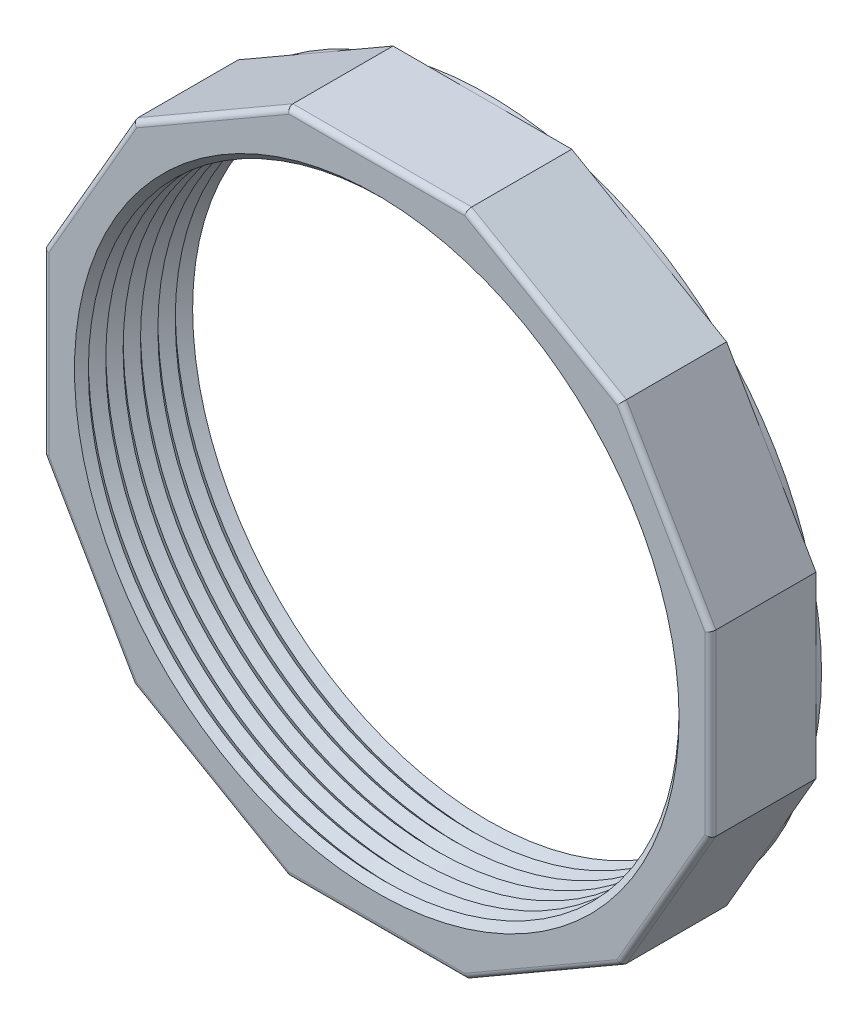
ISO-10303-21;
HEADER;
FILE_DESCRIPTION(('STEP AP214'),'2;1');
FILE_NAME('part.step','',(''),(''),'','','');
FILE_SCHEMA(('AUTOMOTIVE_DESIGN { 1 0 10303 214 1 1 1 1 }'));
ENDSEC;
DATA;
#1=APPLICATION_CONTEXT('core data for automotive mechanical design processes');
#2=APPLICATION_PROTOCOL_DEFINITION('international standard','automotive_design',2000,#1);
#3=PRODUCT_CONTEXT('',#1,'mechanical');
#4=PRODUCT('Part','Part','',(#3));
#5=PRODUCT_RELATED_PRODUCT_CATEGORY('part','',(#4));
#6=PRODUCT_DEFINITION_FORMATION('','',#4);
#7=PRODUCT_DEFINITION_CONTEXT('part definition',#1,'design');
#8=PRODUCT_DEFINITION('design','',#6,#7);
#9=PRODUCT_DEFINITION_SHAPE('','',#8);
#10=(LENGTH_UNIT() NAMED_UNIT(*) SI_UNIT(.MILLI.,.METRE.));
#11=(NAMED_UNIT(*) PLANE_ANGLE_UNIT() SI_UNIT($,.RADIAN.));
#12=(NAMED_UNIT(*) SI_UNIT($,.STERADIAN.) SOLID_ANGLE_UNIT());
#13=UNCERTAINTY_MEASURE_WITH_UNIT(LENGTH_MEASURE(1.E-05),#10,'distance_accuracy_value','');
#14=(GEOMETRIC_REPRESENTATION_CONTEXT(3) GLOBAL_UNCERTAINTY_ASSIGNED_CONTEXT((#13)) GLOBAL_UNIT_ASSIGNED_CONTEXT((#10,
#11,#12)) REPRESENTATION_CONTEXT('',''));
#15=CARTESIAN_POINT('',(0.,0.,0.));
#16=DIRECTION('',(0.,0.,1.));
#17=DIRECTION('',(1.,0.,0.));
#18=AXIS2_PLACEMENT_3D('',#15,#16,#17);
#19=CARTESIAN_POINT('',(0.,0.,3.571875));
#20=DIRECTION('',(0.,0.,-1.));
#21=DIRECTION('',(-1.,0.,0.));
#22=AXIS2_PLACEMENT_3D('',#19,#20,#21);
#23=CONICAL_SURFACE('',#22,13.890625,0.785398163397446);
#24=CARTESIAN_POINT('',(0.,0.,3.571875));
#25=DIRECTION('',(0.,0.,1.));
#26=DIRECTION('',(1.,0.,0.));
#27=AXIS2_PLACEMENT_3D('',#24,#25,#26);
#28=CIRCLE('',#27,13.890625);
#29=CARTESIAN_POINT('',(13.890625,0.,3.571875));
#30=VERTEX_POINT('',#29);
#31=EDGE_CURVE('E202',#30,#30,#28,.F.);
#32=ORIENTED_EDGE('',*,*,#31,.T.);
#33=EDGE_LOOP('',(#32));
#34=FACE_BOUND('',#33,.T.);
#35=CARTESIAN_POINT('',(0.,0.,3.96875));
#36=DIRECTION('',(0.,0.,1.));
#37=DIRECTION('',(1.,0.,0.));
#38=AXIS2_PLACEMENT_3D('',#35,#36,#37);
#39=CIRCLE('',#38,13.49375);
#40=CARTESIAN_POINT('',(13.49375,0.,3.96875));
#41=VERTEX_POINT('',#40);
#42=EDGE_CURVE('E199',#41,#41,#39,.T.);
#43=ORIENTED_EDGE('',*,*,#42,.T.);
#44=EDGE_LOOP('',(#43));
#45=FACE_BOUND('',#44,.T.);
#46=ADVANCED_FACE('F17',(#34,#45),#23,.F.);
#47=CARTESIAN_POINT('',(0.,0.,3.571875));
#48=DIRECTION('',(0.,0.,1.));
#49=DIRECTION('',(1.,0.,0.));
#50=AXIS2_PLACEMENT_3D('',#47,#48,#49);
#51=CONICAL_SURFACE('',#50,13.890625,0.785398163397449);
#52=ORIENTED_EDGE('',*,*,#31,.F.);
#53=EDGE_LOOP('',(#52));
#54=FACE_BOUND('',#53,.T.);
#55=CARTESIAN_POINT('',(0.,0.,3.175));
#56=DIRECTION('',(0.,0.,-1.));
#57=DIRECTION('',(-1.,0.,0.));
#58=AXIS2_PLACEMENT_3D('',#55,#56,#57);
#59=CIRCLE('',#58,13.49375);
#60=CARTESIAN_POINT('',(-13.49375,0.,3.175));
#61=VERTEX_POINT('',#60);
#62=EDGE_CURVE('E196',#61,#61,#59,.T.);
#63=ORIENTED_EDGE('',*,*,#62,.T.);
#64=EDGE_LOOP('',(#63));
#65=FACE_BOUND('',#64,.T.);
#66=ADVANCED_FACE('F728',(#54,#65),#51,.F.);
#67=CARTESIAN_POINT('',(0.,0.,4.365625));
#68=DIRECTION('',(0.,0.,1.));
#69=DIRECTION('',(1.,0.,0.));
#70=AXIS2_PLACEMENT_3D('',#67,#68,#69);
#71=CONICAL_SURFACE('',#70,13.890625,0.785398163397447);
#72=CARTESIAN_POINT('',(0.,0.,4.365625));
#73=DIRECTION('',(0.,0.,-1.));
#74=DIRECTION('',(0.,1.,0.));
#75=AXIS2_PLACEMENT_3D('',#72,#73,#74);
#76=CIRCLE('',#75,13.890625);
#77=CARTESIAN_POINT('',(0.,13.890625,4.365625));
#78=VERTEX_POINT('',#77);
#79=EDGE_CURVE('E193',#78,#78,#76,.F.);
#80=ORIENTED_EDGE('',*,*,#79,.T.);
#81=EDGE_LOOP('',(#80));
#82=FACE_BOUND('',#81,.T.);
#83=ORIENTED_EDGE('',*,*,#42,.F.);
#84=EDGE_LOOP('',(#83));
#85=FACE_BOUND('',#84,.T.);
#86=ADVANCED_FACE('F725',(#82,#85),#71,.F.);
#87=CARTESIAN_POINT('',(0.,0.,2.778125));
#88=DIRECTION('',(0.,0.,-1.));
#89=DIRECTION('',(-1.,0.,0.));
#90=AXIS2_PLACEMENT_3D('',#87,#88,#89);
#91=CONICAL_SURFACE('',#90,13.890625,0.785398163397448);
#92=CARTESIAN_POINT('',(0.,0.,2.778125));
#93=DIRECTION('',(0.,0.,1.));
#94=DIRECTION('',(1.,0.,0.));
#95=AXIS2_PLACEMENT_3D('',#92,#93,#94);
#96=CIRCLE('',#95,13.890625);
#97=CARTESIAN_POINT('',(13.890625,0.,2.778125));
#98=VERTEX_POINT('',#97);
#99=EDGE_CURVE('E190',#98,#98,#96,.F.);
#100=ORIENTED_EDGE('',*,*,#99,.T.);
#101=EDGE_LOOP('',(#100));
#102=FACE_BOUND('',#101,.T.);
#103=ORIENTED_EDGE('',*,*,#62,.F.);
#104=EDGE_LOOP('',(#103));
#105=FACE_BOUND('',#104,.T.);
#106=ADVANCED_FACE('F721',(#102,#105),#91,.F.);
#107=CARTESIAN_POINT('',(0.,0.,4.365625));
#108=DIRECTION('',(0.,0.,-1.));
#109=DIRECTION('',(0.,1.,0.));
#110=AXIS2_PLACEMENT_3D('',#107,#108,#109);
#111=CONICAL_SURFACE('',#110,13.890625,0.785398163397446);
#112=ORIENTED_EDGE('',*,*,#79,.F.);
#113=EDGE_LOOP('',(#112));
#114=FACE_BOUND('',#113,.T.);
#115=CARTESIAN_POINT('',(0.,0.,4.7625));
#116=DIRECTION('',(0.,0.,1.));
#117=DIRECTION('',(1.,0.,0.));
#118=AXIS2_PLACEMENT_3D('',#115,#116,#117);
#119=CIRCLE('',#118,13.49375);
#120=CARTESIAN_POINT('',(13.49375,0.,4.7625));
#121=VERTEX_POINT('',#120);
#122=EDGE_CURVE('E187',#121,#121,#119,.T.);
#123=ORIENTED_EDGE('',*,*,#122,.T.);
#124=EDGE_LOOP('',(#123));
#125=FACE_BOUND('',#124,.T.);
#126=ADVANCED_FACE('F717',(#114,#125),#111,.F.);
#127=CARTESIAN_POINT('',(0.,0.,2.778125));
#128=DIRECTION('',(0.,0.,1.));
#129=DIRECTION('',(1.,0.,0.));
#130=AXIS2_PLACEMENT_3D('',#127,#128,#129);
#131=CONICAL_SURFACE('',#130,13.890625,0.785398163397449);
#132=ORIENTED_EDGE('',*,*,#99,.F.);
#133=EDGE_LOOP('',(#132));
#134=FACE_BOUND('',#133,.T.);
#135=CARTESIAN_POINT('',(0.,0.,2.38125));
#136=DIRECTION('',(0.,0.,-1.));
#137=DIRECTION('',(-1.,0.,0.));
#138=AXIS2_PLACEMENT_3D('',#135,#136,#137);
#139=CIRCLE('',#138,13.49375);
#140=CARTESIAN_POINT('',(-13.49375,0.,2.38125));
#141=VERTEX_POINT('',#140);
#142=EDGE_CURVE('E184',#141,#141,#139,.T.);
#143=ORIENTED_EDGE('',*,*,#142,.T.);
#144=EDGE_LOOP('',(#143));
#145=FACE_BOUND('',#144,.T.);
#146=ADVANCED_FACE('F713',(#134,#145),#131,.F.);
#147=CARTESIAN_POINT('',(0.,0.,5.08));
#148=DIRECTION('',(0.,0.,1.));
#149=DIRECTION('',(1.,0.,0.));
#150=AXIS2_PLACEMENT_3D('',#147,#148,#149);
#151=CONICAL_SURFACE('',#150,13.81125,0.785398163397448);
#152=ORIENTED_EDGE('',*,*,#122,.F.);
#153=EDGE_LOOP('',(#152));
#154=FACE_BOUND('',#153,.T.);
#155=CARTESIAN_POINT('',(0.,0.,5.08));
#156=DIRECTION('',(0.,0.,1.));
#157=DIRECTION('',(1.,0.,0.));
#158=AXIS2_PLACEMENT_3D('',#155,#156,#157);
#159=CIRCLE('',#158,13.81125);
#160=CARTESIAN_POINT('',(13.81125,0.,5.08));
#161=VERTEX_POINT('',#160);
#162=EDGE_CURVE('E20',#161,#161,#159,.F.);
#163=ORIENTED_EDGE('',*,*,#162,.F.);
#164=EDGE_LOOP('',(#163));
#165=FACE_BOUND('',#164,.T.);
#166=ADVANCED_FACE('F709',(#154,#165),#151,.F.);
#167=CARTESIAN_POINT('',(0.,0.,1.984375));
#168=DIRECTION('',(0.,0.,-1.));
#169=DIRECTION('',(-1.,0.,0.));
#170=AXIS2_PLACEMENT_3D('',#167,#168,#169);
#171=CONICAL_SURFACE('',#170,13.890625,0.785398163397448);
#172=CARTESIAN_POINT('',(0.,0.,1.984375));
#173=DIRECTION('',(0.,0.,1.));
#174=DIRECTION('',(1.,0.,0.));
#175=AXIS2_PLACEMENT_3D('',#172,#173,#174);
#176=CIRCLE('',#175,13.890625);
#177=CARTESIAN_POINT('',(13.890625,0.,1.984375));
#178=VERTEX_POINT('',#177);
#179=EDGE_CURVE('E178',#178,#178,#176,.F.);
#180=ORIENTED_EDGE('',*,*,#179,.T.);
#181=EDGE_LOOP('',(#180));
#182=FACE_BOUND('',#181,.T.);
#183=ORIENTED_EDGE('',*,*,#142,.F.);
#184=EDGE_LOOP('',(#183));
#185=FACE_BOUND('',#184,.T.);
#186=ADVANCED_FACE('F706',(#182,#185),#171,.F.);
#187=CARTESIAN_POINT('',(0.,0.,5.08));
#188=DIRECTION('',(0.,0.,1.));
#189=DIRECTION('',(1.,0.,0.));
#190=AXIS2_PLACEMENT_3D('',#187,#188,#189);
#191=PLANE('',#190);
#192=DIRECTION('',(0.866025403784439,-0.5,0.));
#193=VECTOR('',#192,1.);
#194=CARTESIAN_POINT('',(7.493,12.9782567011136,5.08));
#195=LINE('',#194,#193);
#196=CARTESIAN_POINT('',(4.01548659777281,14.986,5.08));
#197=VERTEX_POINT('',#196);
#198=CARTESIAN_POINT('',(10.9705134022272,10.9705134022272,5.08));
#199=VERTEX_POINT('',#198);
#200=EDGE_CURVE('E277',#197,#199,#195,.T.);
#201=ORIENTED_EDGE('',*,*,#200,.F.);
#202=DIRECTION('',(-1.,0.,0.));
#203=VECTOR('',#202,1.);
#204=CARTESIAN_POINT('',(4.08354569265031,14.986,5.08));
#205=LINE('',#204,#203);
#206=CARTESIAN_POINT('',(-4.01548659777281,14.986,5.08));
#207=VERTEX_POINT('',#206);
#208=EDGE_CURVE('E174',#207,#197,#205,.F.);
#209=ORIENTED_EDGE('',*,*,#208,.F.);
#210=DIRECTION('',(0.866025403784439,0.5,0.));
#211=VECTOR('',#210,1.);
#212=CARTESIAN_POINT('',(-7.493,12.9782567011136,5.08));
#213=LINE('',#212,#211);
#214=CARTESIAN_POINT('',(-10.9705134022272,10.9705134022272,5.08));
#215=VERTEX_POINT('',#214);
#216=EDGE_CURVE('E162',#215,#207,#213,.T.);
#217=ORIENTED_EDGE('',*,*,#216,.F.);
#218=DIRECTION('',(-0.5,-0.866025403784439,0.));
#219=VECTOR('',#218,1.);
#220=CARTESIAN_POINT('',(-10.9364838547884,11.0294543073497,5.08));
#221=LINE('',#220,#219);
#222=CARTESIAN_POINT('',(-14.986,4.01548659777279,5.08));
#223=VERTEX_POINT('',#222);
#224=EDGE_CURVE('E159',#223,#215,#221,.F.);
#225=ORIENTED_EDGE('',*,*,#224,.F.);
#226=DIRECTION('',(0.,1.,0.));
#227=VECTOR('',#226,1.);
#228=CARTESIAN_POINT('',(-14.986,0.,5.08));
#229=LINE('',#228,#227);
#230=CARTESIAN_POINT('',(-14.986,-4.01548659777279,5.08));
#231=VERTEX_POINT('',#230);
#232=EDGE_CURVE('E250',#231,#223,#229,.T.);
#233=ORIENTED_EDGE('',*,*,#232,.F.);
#234=DIRECTION('',(0.5,-0.866025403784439,0.));
#235=VECTOR('',#234,1.);
#236=CARTESIAN_POINT('',(-15.0200295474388,-3.9565456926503,5.08));
#237=LINE('',#236,#235);
#238=CARTESIAN_POINT('',(-10.9705134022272,-10.9705134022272,5.08));
#239=VERTEX_POINT('',#238);
#240=EDGE_CURVE('E181',#239,#231,#237,.F.);
#241=ORIENTED_EDGE('',*,*,#240,.F.);
#242=DIRECTION('',(-0.866025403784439,0.5,0.));
#243=VECTOR('',#242,1.);
#244=CARTESIAN_POINT('',(-7.493,-12.9782567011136,5.08));
#245=LINE('',#244,#243);
#246=CARTESIAN_POINT('',(-4.01548659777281,-14.986,5.08));
#247=VERTEX_POINT('',#246);
#248=EDGE_CURVE('E253',#247,#239,#245,.T.);
#249=ORIENTED_EDGE('',*,*,#248,.F.);
#250=DIRECTION('',(1.,0.,0.));
#251=VECTOR('',#250,1.);
#252=CARTESIAN_POINT('',(-4.08354569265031,-14.986,5.08));
#253=LINE('',#252,#251);
#254=CARTESIAN_POINT('',(4.01548659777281,-14.986,5.08));
#255=VERTEX_POINT('',#254);
#256=EDGE_CURVE('E257',#255,#247,#253,.F.);
#257=ORIENTED_EDGE('',*,*,#256,.F.);
#258=DIRECTION('',(-0.866025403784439,-0.5,0.));
#259=VECTOR('',#258,1.);
#260=CARTESIAN_POINT('',(7.493,-12.9782567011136,5.08));
#261=LINE('',#260,#259);
#262=CARTESIAN_POINT('',(10.9705134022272,-10.9705134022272,5.08));
#263=VERTEX_POINT('',#262);
#264=EDGE_CURVE('E261',#263,#255,#261,.T.);
#265=ORIENTED_EDGE('',*,*,#264,.F.);
#266=DIRECTION('',(0.5,0.866025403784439,0.));
#267=VECTOR('',#266,1.);
#268=CARTESIAN_POINT('',(10.9364838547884,-11.0294543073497,5.08));
#269=LINE('',#268,#267);
#270=CARTESIAN_POINT('',(14.986,-4.01548659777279,5.08));
#271=VERTEX_POINT('',#270);
#272=EDGE_CURVE('E265',#271,#263,#269,.F.);
#273=ORIENTED_EDGE('',*,*,#272,.F.);
#274=DIRECTION('',(0.,-1.,0.));
#275=VECTOR('',#274,1.);
#276=CARTESIAN_POINT('',(14.986,0.,5.08));
#277=LINE('',#276,#275);
#278=CARTESIAN_POINT('',(14.986,4.0154865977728,5.08));
#279=VERTEX_POINT('',#278);
#280=EDGE_CURVE('E269',#279,#271,#277,.T.);
#281=ORIENTED_EDGE('',*,*,#280,.F.);
#282=DIRECTION('',(-0.5,0.866025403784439,0.));
#283=VECTOR('',#282,1.);
#284=CARTESIAN_POINT('',(15.0200295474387,3.9565456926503,5.08));
#285=LINE('',#284,#283);
#286=EDGE_CURVE('E273',#199,#279,#285,.F.);
#287=ORIENTED_EDGE('',*,*,#286,.F.);
#288=EDGE_LOOP('',(#201,#209,#217,#225,#233,#241,#249,#257,#265,#273,#281,#287));
#289=FACE_BOUND('',#288,.T.);
#290=ORIENTED_EDGE('',*,*,#162,.T.);
#291=EDGE_LOOP('',(#290));
#292=FACE_BOUND('',#291,.T.);
#293=ADVANCED_FACE('F293',(#289,#292),#191,.T.);
#294=CARTESIAN_POINT('',(0.,0.,1.984375));
#295=DIRECTION('',(0.,0.,1.));
#296=DIRECTION('',(1.,0.,0.));
#297=AXIS2_PLACEMENT_3D('',#294,#295,#296);
#298=CONICAL_SURFACE('',#297,13.890625,0.785398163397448);
#299=ORIENTED_EDGE('',*,*,#179,.F.);
#300=EDGE_LOOP('',(#299));
#301=FACE_BOUND('',#300,.T.);
#302=CARTESIAN_POINT('',(0.,0.,1.5875));
#303=DIRECTION('',(0.,0.,-1.));
#304=DIRECTION('',(-1.,0.,0.));
#305=AXIS2_PLACEMENT_3D('',#302,#303,#304);
#306=CIRCLE('',#305,13.49375);
#307=CARTESIAN_POINT('',(-13.49375,0.,1.5875));
#308=VERTEX_POINT('',#307);
#309=EDGE_CURVE('E142',#308,#308,#306,.T.);
#310=ORIENTED_EDGE('',*,*,#309,.T.);
#311=EDGE_LOOP('',(#310));
#312=FACE_BOUND('',#311,.T.);
#313=ADVANCED_FACE('F700',(#301,#312),#298,.F.);
#314=CARTESIAN_POINT('',(-10.9364838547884,11.0294543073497,4.826));
#315=DIRECTION('',(-0.5,-0.866025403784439,0.));
#316=DIRECTION('',(0.866025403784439,-0.5,0.));
#317=AXIS2_PLACEMENT_3D('',#314,#315,#316);
#318=CYLINDRICAL_SURFACE('',#317,0.254);
#319=CARTESIAN_POINT('',(-14.986,4.01548659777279,4.826));
#320=DIRECTION('',(0.258819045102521,0.965925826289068,0.));
#321=DIRECTION('',(-0.965925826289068,0.258819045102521,0.));
#322=AXIS2_PLACEMENT_3D('',#319,#320,#321);
#323=ELLIPSE('',#322,0.262960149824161,0.254);
#324=CARTESIAN_POINT('',(-15.24,4.08354569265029,4.826));
#325=VERTEX_POINT('',#324);
#326=EDGE_CURVE('E251',#223,#325,#323,.F.);
#327=ORIENTED_EDGE('',*,*,#326,.F.);
#328=ORIENTED_EDGE('',*,*,#224,.T.);
#329=CARTESIAN_POINT('',(-10.9705134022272,10.9705134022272,4.826));
#330=DIRECTION('',(0.707106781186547,0.707106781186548,0.));
#331=DIRECTION('',(0.707106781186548,-0.707106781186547,0.));
#332=AXIS2_PLACEMENT_3D('',#329,#330,#331);
#333=ELLIPSE('',#332,0.262960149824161,0.254);
#334=CARTESIAN_POINT('',(-11.1564543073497,11.1564543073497,4.826));
#335=VERTEX_POINT('',#334);
#336=EDGE_CURVE('E157',#335,#215,#333,.T.);
#337=ORIENTED_EDGE('',*,*,#336,.F.);
#338=DIRECTION('',(0.5,0.866025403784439,0.));
#339=VECTOR('',#338,1.);
#340=CARTESIAN_POINT('',(-11.1564543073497,11.1564543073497,4.826));
#341=LINE('',#340,#339);
#342=EDGE_CURVE('E128',#335,#325,#341,.F.);
#343=ORIENTED_EDGE('',*,*,#342,.T.);
#344=EDGE_LOOP('',(#327,#328,#337,#343));
#345=FACE_BOUND('',#344,.T.);
#346=ADVANCED_FACE('F158',(#345),#318,.T.);
#347=CARTESIAN_POINT('',(-7.493,12.9782567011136,4.826));
#348=DIRECTION('',(0.866025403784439,0.5,0.));
#349=DIRECTION('',(-0.5,0.866025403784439,0.));
#350=AXIS2_PLACEMENT_3D('',#347,#348,#349);
#351=CYLINDRICAL_SURFACE('',#350,0.254);
#352=CARTESIAN_POINT('',(-4.0154865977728,14.986,4.826));
#353=DIRECTION('',(-0.965925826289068,-0.258819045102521,0.));
#354=DIRECTION('',(-0.258819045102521,0.965925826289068,0.));
#355=AXIS2_PLACEMENT_3D('',#352,#353,#354);
#356=ELLIPSE('',#355,0.262960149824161,0.254);
#357=CARTESIAN_POINT('',(-4.08354569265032,15.24,4.826));
#358=VERTEX_POINT('',#357);
#359=EDGE_CURVE('E166',#358,#207,#356,.F.);
#360=ORIENTED_EDGE('',*,*,#359,.F.);
#361=DIRECTION('',(0.866025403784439,0.5,0.));
#362=VECTOR('',#361,1.);
#363=CARTESIAN_POINT('',(-15.0031551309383,8.93556055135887,4.826));
#364=LINE('',#363,#362);
#365=EDGE_CURVE('E149',#358,#335,#364,.F.);
#366=ORIENTED_EDGE('',*,*,#365,.T.);
#367=ORIENTED_EDGE('',*,*,#336,.T.);
#368=ORIENTED_EDGE('',*,*,#216,.T.);
#369=EDGE_LOOP('',(#360,#366,#367,#368));
#370=FACE_BOUND('',#369,.T.);
#371=ADVANCED_FACE('F164',(#370),#351,.T.);
#372=CARTESIAN_POINT('',(4.08354569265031,14.986,4.826));
#373=DIRECTION('',(-1.,0.,0.));
#374=DIRECTION('',(0.,-1.,0.));
#375=AXIS2_PLACEMENT_3D('',#372,#373,#374);
#376=CYLINDRICAL_SURFACE('',#375,0.254000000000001);
#377=CARTESIAN_POINT('',(4.01548659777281,14.986,4.826));
#378=DIRECTION('',(0.965925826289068,-0.258819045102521,0.));
#379=DIRECTION('',(-0.258819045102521,-0.965925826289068,0.));
#380=AXIS2_PLACEMENT_3D('',#377,#378,#379);
#381=ELLIPSE('',#380,0.262960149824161,0.254);
#382=CARTESIAN_POINT('',(4.08354569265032,15.24,4.826));
#383=VERTEX_POINT('',#382);
#384=EDGE_CURVE('E278',#383,#197,#381,.T.);
#385=ORIENTED_EDGE('',*,*,#384,.F.);
#386=DIRECTION('',(1.,0.,0.));
#387=VECTOR('',#386,1.);
#388=CARTESIAN_POINT('',(4.08354569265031,15.24,4.826));
#389=LINE('',#388,#387);
#390=EDGE_CURVE('E170',#383,#358,#389,.F.);
#391=ORIENTED_EDGE('',*,*,#390,.T.);
#392=ORIENTED_EDGE('',*,*,#359,.T.);
#393=ORIENTED_EDGE('',*,*,#208,.T.);
#394=EDGE_LOOP('',(#385,#391,#392,#393));
#395=FACE_BOUND('',#394,.T.);
#396=ADVANCED_FACE('F284',(#395),#376,.T.);
#397=CARTESIAN_POINT('',(7.493,12.9782567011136,4.826));
#398=DIRECTION('',(0.866025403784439,-0.5,0.));
#399=DIRECTION('',(0.5,0.866025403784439,0.));
#400=AXIS2_PLACEMENT_3D('',#397,#398,#399);
#401=CYLINDRICAL_SURFACE('',#400,0.254);
#402=CARTESIAN_POINT('',(10.9705134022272,10.9705134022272,4.826));
#403=DIRECTION('',(-0.707106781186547,0.707106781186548,0.));
#404=DIRECTION('',(0.707106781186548,0.707106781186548,0.));
#405=AXIS2_PLACEMENT_3D('',#402,#403,#404);
#406=ELLIPSE('',#405,0.262960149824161,0.254);
#407=CARTESIAN_POINT('',(11.1564543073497,11.1564543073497,4.826));
#408=VERTEX_POINT('',#407);
#409=EDGE_CURVE('E274',#408,#199,#406,.F.);
#410=ORIENTED_EDGE('',*,*,#409,.F.);
#411=DIRECTION('',(0.866025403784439,-0.5,0.));
#412=VECTOR('',#411,1.);
#413=CARTESIAN_POINT('',(0.236844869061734,17.4608937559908,4.826));
#414=LINE('',#413,#412);
#415=EDGE_CURVE('E291',#408,#383,#414,.F.);
#416=ORIENTED_EDGE('',*,*,#415,.T.);
#417=ORIENTED_EDGE('',*,*,#384,.T.);
#418=ORIENTED_EDGE('',*,*,#200,.T.);
#419=EDGE_LOOP('',(#410,#416,#417,#418));
#420=FACE_BOUND('',#419,.T.);
#421=ADVANCED_FACE('F290',(#420),#401,.T.);
#422=CARTESIAN_POINT('',(15.0200295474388,3.9565456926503,4.826));
#423=DIRECTION('',(-0.5,0.866025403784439,0.));
#424=DIRECTION('',(-0.866025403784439,-0.5,0.));
#425=AXIS2_PLACEMENT_3D('',#422,#423,#424);
#426=CYLINDRICAL_SURFACE('',#425,0.254);
#427=CARTESIAN_POINT('',(14.986,4.0154865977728,4.826));
#428=DIRECTION('',(0.258819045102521,-0.965925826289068,0.));
#429=DIRECTION('',(-0.965925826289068,-0.258819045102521,0.));
#430=AXIS2_PLACEMENT_3D('',#427,#428,#429);
#431=ELLIPSE('',#430,0.262960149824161,0.254);
#432=CARTESIAN_POINT('',(15.24,4.0835456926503,4.826));
#433=VERTEX_POINT('',#432);
#434=EDGE_CURVE('E270',#433,#279,#431,.T.);
#435=ORIENTED_EDGE('',*,*,#434,.F.);
#436=DIRECTION('',(0.5,-0.866025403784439,0.));
#437=VECTOR('',#436,1.);
#438=CARTESIAN_POINT('',(15.24,4.08354569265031,4.826));
#439=LINE('',#438,#437);
#440=EDGE_CURVE('E327',#433,#408,#439,.F.);
#441=ORIENTED_EDGE('',*,*,#440,.T.);
#442=ORIENTED_EDGE('',*,*,#409,.T.);
#443=ORIENTED_EDGE('',*,*,#286,.T.);
#444=EDGE_LOOP('',(#435,#441,#442,#443));
#445=FACE_BOUND('',#444,.T.);
#446=ADVANCED_FACE('F370',(#445),#426,.T.);
#447=CARTESIAN_POINT('',(14.986,0.,4.826));
#448=DIRECTION('',(0.,-1.,0.));
#449=DIRECTION('',(0.,0.,-1.));
#450=AXIS2_PLACEMENT_3D('',#447,#448,#449);
#451=CYLINDRICAL_SURFACE('',#450,0.254);
#452=CARTESIAN_POINT('',(14.986,-4.0154865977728,4.826));
#453=DIRECTION('',(0.258819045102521,0.965925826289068,0.));
#454=DIRECTION('',(0.965925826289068,-0.258819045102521,0.));
#455=AXIS2_PLACEMENT_3D('',#452,#453,#454);
#456=ELLIPSE('',#455,0.262960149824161,0.254);
#457=CARTESIAN_POINT('',(15.24,-4.0835456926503,4.826));
#458=VERTEX_POINT('',#457);
#459=EDGE_CURVE('E266',#458,#271,#456,.F.);
#460=ORIENTED_EDGE('',*,*,#459,.F.);
#461=DIRECTION('',(0.,1.,0.));
#462=VECTOR('',#461,1.);
#463=CARTESIAN_POINT('',(15.24,8.52533320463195,4.826));
#464=LINE('',#463,#462);
#465=EDGE_CURVE('E326',#458,#433,#464,.T.);
#466=ORIENTED_EDGE('',*,*,#465,.T.);
#467=ORIENTED_EDGE('',*,*,#434,.T.);
#468=ORIENTED_EDGE('',*,*,#280,.T.);
#469=EDGE_LOOP('',(#460,#466,#467,#468));
#470=FACE_BOUND('',#469,.T.);
#471=ADVANCED_FACE('F373',(#470),#451,.T.);
#472=CARTESIAN_POINT('',(10.9364838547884,-11.0294543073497,4.826));
#473=DIRECTION('',(0.5,0.866025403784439,0.));
#474=DIRECTION('',(-0.866025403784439,0.5,0.));
#475=AXIS2_PLACEMENT_3D('',#472,#473,#474);
#476=CYLINDRICAL_SURFACE('',#475,0.254);
#477=ORIENTED_EDGE('',*,*,#459,.T.);
#478=ORIENTED_EDGE('',*,*,#272,.T.);
#479=CARTESIAN_POINT('',(10.9705134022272,-10.9705134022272,4.826));
#480=DIRECTION('',(-0.707106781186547,-0.707106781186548,0.));
#481=DIRECTION('',(-0.707106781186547,0.707106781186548,0.));
#482=AXIS2_PLACEMENT_3D('',#479,#480,#481);
#483=ELLIPSE('',#482,0.262960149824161,0.254);
#484=CARTESIAN_POINT('',(11.1564543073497,-11.1564543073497,4.826));
#485=VERTEX_POINT('',#484);
#486=EDGE_CURVE('E262',#485,#263,#483,.T.);
#487=ORIENTED_EDGE('',*,*,#486,.F.);
#488=DIRECTION('',(-0.5,-0.866025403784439,0.));
#489=VECTOR('',#488,1.);
#490=CARTESIAN_POINT('',(11.1564543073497,-11.1564543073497,4.826));
#491=LINE('',#490,#489);
#492=EDGE_CURVE('E359',#485,#458,#491,.F.);
#493=ORIENTED_EDGE('',*,*,#492,.T.);
#494=EDGE_LOOP('',(#477,#478,#487,#493));
#495=FACE_BOUND('',#494,.T.);
#496=ADVANCED_FACE('F379',(#495),#476,.T.);
#497=CARTESIAN_POINT('',(7.493,-12.9782567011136,4.826));
#498=DIRECTION('',(-0.866025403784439,-0.5,0.));
#499=DIRECTION('',(0.5,-0.866025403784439,0.));
#500=AXIS2_PLACEMENT_3D('',#497,#498,#499);
#501=CYLINDRICAL_SURFACE('',#500,0.253999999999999);
#502=ORIENTED_EDGE('',*,*,#486,.T.);
#503=ORIENTED_EDGE('',*,*,#264,.T.);
#504=CARTESIAN_POINT('',(4.01548659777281,-14.986,4.826));
#505=DIRECTION('',(0.965925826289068,0.258819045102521,0.));
#506=DIRECTION('',(0.258819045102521,-0.965925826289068,0.));
#507=AXIS2_PLACEMENT_3D('',#504,#505,#506);
#508=ELLIPSE('',#507,0.262960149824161,0.254);
#509=CARTESIAN_POINT('',(4.08354569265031,-15.24,4.826));
#510=VERTEX_POINT('',#509);
#511=EDGE_CURVE('E258',#510,#255,#508,.F.);
#512=ORIENTED_EDGE('',*,*,#511,.F.);
#513=DIRECTION('',(-0.866025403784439,-0.5,0.));
#514=VECTOR('',#513,1.);
#515=CARTESIAN_POINT('',(15.0031551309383,-8.93556055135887,4.826));
#516=LINE('',#515,#514);
#517=EDGE_CURVE('E354',#510,#485,#516,.F.);
#518=ORIENTED_EDGE('',*,*,#517,.T.);
#519=EDGE_LOOP('',(#502,#503,#512,#518));
#520=FACE_BOUND('',#519,.T.);
#521=ADVANCED_FACE('F381',(#520),#501,.T.);
#522=CARTESIAN_POINT('',(-4.08354569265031,-14.986,4.826));
#523=DIRECTION('',(1.,0.,0.));
#524=DIRECTION('',(0.,1.,0.));
#525=AXIS2_PLACEMENT_3D('',#522,#523,#524);
#526=CYLINDRICAL_SURFACE('',#525,0.254000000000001);
#527=ORIENTED_EDGE('',*,*,#511,.T.);
#528=ORIENTED_EDGE('',*,*,#256,.T.);
#529=CARTESIAN_POINT('',(-4.01548659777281,-14.986,4.826));
#530=DIRECTION('',(-0.965925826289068,0.258819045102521,0.));
#531=DIRECTION('',(0.258819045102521,0.965925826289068,0.));
#532=AXIS2_PLACEMENT_3D('',#529,#530,#531);
#533=ELLIPSE('',#532,0.262960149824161,0.254);
#534=CARTESIAN_POINT('',(-4.08354569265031,-15.24,4.826));
#535=VERTEX_POINT('',#534);
#536=EDGE_CURVE('E254',#535,#247,#533,.T.);
#537=ORIENTED_EDGE('',*,*,#536,.F.);
#538=DIRECTION('',(-1.,0.,0.));
#539=VECTOR('',#538,1.);
#540=CARTESIAN_POINT('',(-4.08354569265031,-15.24,4.826));
#541=LINE('',#540,#539);
#542=EDGE_CURVE('E349',#535,#510,#541,.F.);
#543=ORIENTED_EDGE('',*,*,#542,.T.);
#544=EDGE_LOOP('',(#527,#528,#537,#543));
#545=FACE_BOUND('',#544,.T.);
#546=ADVANCED_FACE('F679',(#545),#526,.T.);
#547=CARTESIAN_POINT('',(-7.493,-12.9782567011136,4.826));
#548=DIRECTION('',(-0.866025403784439,0.5,0.));
#549=DIRECTION('',(-0.5,-0.866025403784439,0.));
#550=AXIS2_PLACEMENT_3D('',#547,#548,#549);
#551=CYLINDRICAL_SURFACE('',#550,0.254);
#552=ORIENTED_EDGE('',*,*,#536,.T.);
#553=ORIENTED_EDGE('',*,*,#248,.T.);
#554=CARTESIAN_POINT('',(-10.9705134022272,-10.9705134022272,4.826));
#555=DIRECTION('',(0.707106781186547,-0.707106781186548,0.));
#556=DIRECTION('',(-0.707106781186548,-0.707106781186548,0.));
#557=AXIS2_PLACEMENT_3D('',#554,#555,#556);
#558=ELLIPSE('',#557,0.262960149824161,0.254);
#559=CARTESIAN_POINT('',(-11.1564543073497,-11.1564543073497,4.826));
#560=VERTEX_POINT('',#559);
#561=EDGE_CURVE('E245',#560,#239,#558,.F.);
#562=ORIENTED_EDGE('',*,*,#561,.F.);
#563=DIRECTION('',(-0.866025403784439,0.5,0.));
#564=VECTOR('',#563,1.);
#565=CARTESIAN_POINT('',(-0.236844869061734,-17.4608937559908,4.826));
#566=LINE('',#565,#564);
#567=EDGE_CURVE('E320',#560,#535,#566,.F.);
#568=ORIENTED_EDGE('',*,*,#567,.T.);
#569=EDGE_LOOP('',(#552,#553,#562,#568));
#570=FACE_BOUND('',#569,.T.);
#571=ADVANCED_FACE('F675',(#570),#551,.T.);
#572=CARTESIAN_POINT('',(-14.986,0.,4.826));
#573=DIRECTION('',(0.,1.,0.));
#574=DIRECTION('',(0.,0.,1.));
#575=AXIS2_PLACEMENT_3D('',#572,#573,#574);
#576=CYLINDRICAL_SURFACE('',#575,0.254);
#577=CARTESIAN_POINT('',(-14.986,-4.01548659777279,4.826));
#578=DIRECTION('',(0.258819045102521,-0.965925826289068,0.));
#579=DIRECTION('',(0.965925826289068,0.258819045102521,0.));
#580=AXIS2_PLACEMENT_3D('',#577,#578,#579);
#581=ELLIPSE('',#580,0.262960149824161,0.254);
#582=CARTESIAN_POINT('',(-15.24,-4.0835456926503,4.826));
#583=VERTEX_POINT('',#582);
#584=EDGE_CURVE('E248',#231,#583,#581,.T.);
#585=ORIENTED_EDGE('',*,*,#584,.F.);
#586=ORIENTED_EDGE('',*,*,#232,.T.);
#587=ORIENTED_EDGE('',*,*,#326,.T.);
#588=DIRECTION('',(0.,1.,0.));
#589=VECTOR('',#588,1.);
#590=CARTESIAN_POINT('',(-15.24,-8.52533320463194,4.826));
#591=LINE('',#590,#589);
#592=EDGE_CURVE('E319',#325,#583,#591,.F.);
#593=ORIENTED_EDGE('',*,*,#592,.T.);
#594=EDGE_LOOP('',(#585,#586,#587,#593));
#595=FACE_BOUND('',#594,.T.);
#596=ADVANCED_FACE('F671',(#595),#576,.T.);
#597=CARTESIAN_POINT('',(-15.0200295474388,-3.9565456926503,4.826));
#598=DIRECTION('',(0.5,-0.866025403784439,0.));
#599=DIRECTION('',(0.866025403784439,0.5,0.));
#600=AXIS2_PLACEMENT_3D('',#597,#598,#599);
#601=CYLINDRICAL_SURFACE('',#600,0.254);
#602=ORIENTED_EDGE('',*,*,#561,.T.);
#603=ORIENTED_EDGE('',*,*,#240,.T.);
#604=ORIENTED_EDGE('',*,*,#584,.T.);
#605=DIRECTION('',(-0.5,0.866025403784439,0.));
#606=VECTOR('',#605,1.);
#607=CARTESIAN_POINT('',(-15.24,-4.0835456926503,4.826));
#608=LINE('',#607,#606);
#609=EDGE_CURVE('E334',#583,#560,#608,.F.);
#610=ORIENTED_EDGE('',*,*,#609,.T.);
#611=EDGE_LOOP('',(#602,#603,#604,#610));
#612=FACE_BOUND('',#611,.T.);
#613=ADVANCED_FACE('F667',(#612),#601,.T.);
#614=CARTESIAN_POINT('',(0.,0.,1.190625));
#615=DIRECTION('',(0.,0.,-1.));
#616=DIRECTION('',(-1.,0.,0.));
#617=AXIS2_PLACEMENT_3D('',#614,#615,#616);
#618=CONICAL_SURFACE('',#617,13.890625,0.785398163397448);
#619=CARTESIAN_POINT('',(0.,0.,1.190625));
#620=DIRECTION('',(0.,0.,1.));
#621=DIRECTION('',(1.,0.,0.));
#622=AXIS2_PLACEMENT_3D('',#619,#620,#621);
#623=CIRCLE('',#622,13.890625);
#624=CARTESIAN_POINT('',(13.890625,0.,1.190625));
#625=VERTEX_POINT('',#624);
#626=EDGE_CURVE('E330',#625,#625,#623,.F.);
#627=ORIENTED_EDGE('',*,*,#626,.T.);
#628=EDGE_LOOP('',(#627));
#629=FACE_BOUND('',#628,.T.);
#630=ORIENTED_EDGE('',*,*,#309,.F.);
#631=EDGE_LOOP('',(#630));
#632=FACE_BOUND('',#631,.T.);
#633=ADVANCED_FACE('F664',(#629,#632),#618,.F.);
#634=CARTESIAN_POINT('',(-11.1564543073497,11.1564543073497,0.));
#635=DIRECTION('',(0.866025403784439,-0.5,0.));
#636=DIRECTION('',(0.5,0.866025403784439,0.));
#637=AXIS2_PLACEMENT_3D('',#634,#635,#636);
#638=PLANE('',#637);
#639=DIRECTION('',(0.,0.,1.));
#640=VECTOR('',#639,1.);
#641=CARTESIAN_POINT('',(-11.1564543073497,11.1564543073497,5.08));
#642=LINE('',#641,#640);
#643=CARTESIAN_POINT('',(-11.1564543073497,11.1564543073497,0.254));
#644=VERTEX_POINT('',#643);
#645=EDGE_CURVE('E133',#335,#644,#642,.F.);
#646=ORIENTED_EDGE('',*,*,#645,.T.);
#647=DIRECTION('',(0.5,0.866025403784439,0.));
#648=VECTOR('',#647,1.);
#649=CARTESIAN_POINT('',(-13.1982271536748,7.62,0.254));
#650=LINE('',#649,#648);
#651=CARTESIAN_POINT('',(-13.1982271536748,7.61999999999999,0.254));
#652=VERTEX_POINT('',#651);
#653=EDGE_CURVE('E463',#652,#644,#650,.T.);
#654=ORIENTED_EDGE('',*,*,#653,.F.);
#655=DIRECTION('',(0.5,0.866025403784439,0.));
#656=VECTOR('',#655,1.);
#657=CARTESIAN_POINT('',(-15.24,4.0835456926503,0.254));
#658=LINE('',#657,#656);
#659=CARTESIAN_POINT('',(-15.24,4.08354569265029,0.254));
#660=VERTEX_POINT('',#659);
#661=EDGE_CURVE('E470',#660,#652,#658,.T.);
#662=ORIENTED_EDGE('',*,*,#661,.F.);
#663=DIRECTION('',(0.,0.,-1.));
#664=VECTOR('',#663,1.);
#665=CARTESIAN_POINT('',(-15.24,4.0835456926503,5.08));
#666=LINE('',#665,#664);
#667=EDGE_CURVE('E137',#660,#325,#666,.F.);
#668=ORIENTED_EDGE('',*,*,#667,.T.);
#669=ORIENTED_EDGE('',*,*,#342,.F.);
#670=EDGE_LOOP('',(#646,#654,#662,#668,#669));
#671=FACE_BOUND('',#670,.T.);
#672=ADVANCED_FACE('F130',(#671),#638,.F.);
#673=CARTESIAN_POINT('',(-15.0031551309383,8.93556055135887,5.08));
#674=DIRECTION('',(0.5,-0.866025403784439,0.));
#675=DIRECTION('',(0.866025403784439,0.5,0.));
#676=AXIS2_PLACEMENT_3D('',#673,#674,#675);
#677=PLANE('',#676);
#678=DIRECTION('',(0.,0.,1.));
#679=VECTOR('',#678,1.);
#680=CARTESIAN_POINT('',(-4.08354569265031,15.24,0.));
#681=LINE('',#680,#679);
#682=CARTESIAN_POINT('',(-4.08354569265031,15.24,0.254));
#683=VERTEX_POINT('',#682);
#684=EDGE_CURVE('E168',#358,#683,#681,.F.);
#685=ORIENTED_EDGE('',*,*,#684,.T.);
#686=DIRECTION('',(0.866025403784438,0.500000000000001,0.));
#687=VECTOR('',#686,1.);
#688=CARTESIAN_POINT('',(-7.61999999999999,13.1982271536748,0.254));
#689=LINE('',#688,#687);
#690=CARTESIAN_POINT('',(-7.61999999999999,13.1982271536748,0.254));
#691=VERTEX_POINT('',#690);
#692=EDGE_CURVE('E458',#691,#683,#689,.T.);
#693=ORIENTED_EDGE('',*,*,#692,.F.);
#694=DIRECTION('',(0.866025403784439,0.499999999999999,0.));
#695=VECTOR('',#694,1.);
#696=CARTESIAN_POINT('',(-11.1564543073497,11.1564543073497,0.254));
#697=LINE('',#696,#695);
#698=EDGE_CURVE('E153',#644,#691,#697,.T.);
#699=ORIENTED_EDGE('',*,*,#698,.F.);
#700=ORIENTED_EDGE('',*,*,#645,.F.);
#701=ORIENTED_EDGE('',*,*,#365,.F.);
#702=EDGE_LOOP('',(#685,#693,#699,#700,#701));
#703=FACE_BOUND('',#702,.T.);
#704=ADVANCED_FACE('F147',(#703),#677,.F.);
#705=CARTESIAN_POINT('',(4.08354569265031,15.24,0.));
#706=DIRECTION('',(0.,-1.,0.));
#707=DIRECTION('',(1.,0.,0.));
#708=AXIS2_PLACEMENT_3D('',#705,#706,#707);
#709=PLANE('',#708);
#710=DIRECTION('',(0.,0.,1.));
#711=VECTOR('',#710,1.);
#712=CARTESIAN_POINT('',(4.08354569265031,15.24,5.08));
#713=LINE('',#712,#711);
#714=CARTESIAN_POINT('',(4.08354569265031,15.24,0.254));
#715=VERTEX_POINT('',#714);
#716=EDGE_CURVE('E299',#383,#715,#713,.F.);
#717=ORIENTED_EDGE('',*,*,#716,.T.);
#718=DIRECTION('',(-1.,0.,0.));
#719=VECTOR('',#718,1.);
#720=CARTESIAN_POINT('',(0.,15.24,0.254));
#721=LINE('',#720,#719);
#722=CARTESIAN_POINT('',(0.,15.24,0.254));
#723=VERTEX_POINT('',#722);
#724=EDGE_CURVE('E438',#723,#715,#721,.F.);
#725=ORIENTED_EDGE('',*,*,#724,.F.);
#726=DIRECTION('',(-1.,0.,0.));
#727=VECTOR('',#726,1.);
#728=CARTESIAN_POINT('',(0.,15.24,0.254));
#729=LINE('',#728,#727);
#730=EDGE_CURVE('E453',#683,#723,#729,.F.);
#731=ORIENTED_EDGE('',*,*,#730,.F.);
#732=ORIENTED_EDGE('',*,*,#684,.F.);
#733=ORIENTED_EDGE('',*,*,#390,.F.);
#734=EDGE_LOOP('',(#717,#725,#731,#732,#733));
#735=FACE_BOUND('',#734,.T.);
#736=ADVANCED_FACE('F657',(#735),#709,.F.);
#737=CARTESIAN_POINT('',(0.236844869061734,17.4608937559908,5.08));
#738=DIRECTION('',(-0.5,-0.866025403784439,0.));
#739=DIRECTION('',(0.866025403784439,-0.5,0.));
#740=AXIS2_PLACEMENT_3D('',#737,#738,#739);
#741=PLANE('',#740);
#742=DIRECTION('',(0.,0.,1.));
#743=VECTOR('',#742,1.);
#744=CARTESIAN_POINT('',(11.1564543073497,11.1564543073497,0.));
#745=LINE('',#744,#743);
#746=CARTESIAN_POINT('',(11.1564543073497,11.1564543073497,0.254));
#747=VERTEX_POINT('',#746);
#748=EDGE_CURVE('E307',#408,#747,#745,.F.);
#749=ORIENTED_EDGE('',*,*,#748,.T.);
#750=DIRECTION('',(0.866025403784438,-0.500000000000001,0.));
#751=VECTOR('',#750,1.);
#752=CARTESIAN_POINT('',(7.62,13.1982271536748,0.254));
#753=LINE('',#752,#751);
#754=CARTESIAN_POINT('',(7.62,13.1982271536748,0.254));
#755=VERTEX_POINT('',#754);
#756=EDGE_CURVE('E422',#755,#747,#753,.T.);
#757=ORIENTED_EDGE('',*,*,#756,.F.);
#758=DIRECTION('',(0.866025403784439,-0.5,0.));
#759=VECTOR('',#758,1.);
#760=CARTESIAN_POINT('',(4.08354569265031,15.24,0.254));
#761=LINE('',#760,#759);
#762=EDGE_CURVE('E448',#715,#755,#761,.T.);
#763=ORIENTED_EDGE('',*,*,#762,.F.);
#764=ORIENTED_EDGE('',*,*,#716,.F.);
#765=ORIENTED_EDGE('',*,*,#415,.F.);
#766=EDGE_LOOP('',(#749,#757,#763,#764,#765));
#767=FACE_BOUND('',#766,.T.);
#768=ADVANCED_FACE('F419',(#767),#741,.F.);
#769=CARTESIAN_POINT('',(15.24,4.08354569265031,0.));
#770=DIRECTION('',(-0.866025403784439,-0.5,0.));
#771=DIRECTION('',(0.5,-0.866025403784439,0.));
#772=AXIS2_PLACEMENT_3D('',#769,#770,#771);
#773=PLANE('',#772);
#774=DIRECTION('',(0.,0.,1.));
#775=VECTOR('',#774,1.);
#776=CARTESIAN_POINT('',(15.24,4.08354569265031,5.08));
#777=LINE('',#776,#775);
#778=CARTESIAN_POINT('',(15.24,4.08354569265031,0.254));
#779=VERTEX_POINT('',#778);
#780=EDGE_CURVE('E323',#433,#779,#777,.F.);
#781=ORIENTED_EDGE('',*,*,#780,.T.);
#782=DIRECTION('',(0.5,-0.866025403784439,0.));
#783=VECTOR('',#782,1.);
#784=CARTESIAN_POINT('',(13.1982271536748,7.62,0.254));
#785=LINE('',#784,#783);
#786=CARTESIAN_POINT('',(13.1982271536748,7.62,0.254));
#787=VERTEX_POINT('',#786);
#788=EDGE_CURVE('E431',#787,#779,#785,.T.);
#789=ORIENTED_EDGE('',*,*,#788,.F.);
#790=DIRECTION('',(0.5,-0.866025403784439,0.));
#791=VECTOR('',#790,1.);
#792=CARTESIAN_POINT('',(11.1564543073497,11.1564543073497,0.254));
#793=LINE('',#792,#791);
#794=EDGE_CURVE('E428',#747,#787,#793,.T.);
#795=ORIENTED_EDGE('',*,*,#794,.F.);
#796=ORIENTED_EDGE('',*,*,#748,.F.);
#797=ORIENTED_EDGE('',*,*,#440,.F.);
#798=EDGE_LOOP('',(#781,#789,#795,#796,#797));
#799=FACE_BOUND('',#798,.T.);
#800=ADVANCED_FACE('F429',(#799),#773,.F.);
#801=CARTESIAN_POINT('',(15.24,8.52533320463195,5.08));
#802=DIRECTION('',(-1.,0.,0.));
#803=DIRECTION('',(0.,0.,1.));
#804=AXIS2_PLACEMENT_3D('',#801,#802,#803);
#805=PLANE('',#804);
#806=DIRECTION('',(0.,0.,1.));
#807=VECTOR('',#806,1.);
#808=CARTESIAN_POINT('',(15.24,-4.0835456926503,0.));
#809=LINE('',#808,#807);
#810=CARTESIAN_POINT('',(15.24,-4.0835456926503,0.254));
#811=VERTEX_POINT('',#810);
#812=EDGE_CURVE('E362',#458,#811,#809,.F.);
#813=ORIENTED_EDGE('',*,*,#812,.T.);
#814=DIRECTION('',(0.,1.,0.));
#815=VECTOR('',#814,1.);
#816=CARTESIAN_POINT('',(15.24,0.,0.254));
#817=LINE('',#816,#815);
#818=CARTESIAN_POINT('',(15.24,0.,0.254));
#819=VERTEX_POINT('',#818);
#820=EDGE_CURVE('E433',#819,#811,#817,.F.);
#821=ORIENTED_EDGE('',*,*,#820,.F.);
#822=DIRECTION('',(0.,1.,0.));
#823=VECTOR('',#822,1.);
#824=CARTESIAN_POINT('',(15.24,0.,0.254));
#825=LINE('',#824,#823);
#826=EDGE_CURVE('E333',#779,#819,#825,.F.);
#827=ORIENTED_EDGE('',*,*,#826,.F.);
#828=ORIENTED_EDGE('',*,*,#780,.F.);
#829=ORIENTED_EDGE('',*,*,#465,.F.);
#830=EDGE_LOOP('',(#813,#821,#827,#828,#829));
#831=FACE_BOUND('',#830,.T.);
#832=ADVANCED_FACE('F644',(#831),#805,.F.);
#833=CARTESIAN_POINT('',(11.1564543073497,-11.1564543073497,0.));
#834=DIRECTION('',(-0.866025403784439,0.5,0.));
#835=DIRECTION('',(-0.5,-0.866025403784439,0.));
#836=AXIS2_PLACEMENT_3D('',#833,#834,#835);
#837=PLANE('',#836);
#838=DIRECTION('',(0.,0.,1.));
#839=VECTOR('',#838,1.);
#840=CARTESIAN_POINT('',(11.1564543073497,-11.1564543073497,5.08));
#841=LINE('',#840,#839);
#842=CARTESIAN_POINT('',(11.1564543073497,-11.1564543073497,0.254));
#843=VERTEX_POINT('',#842);
#844=EDGE_CURVE('E357',#485,#843,#841,.F.);
#845=ORIENTED_EDGE('',*,*,#844,.T.);
#846=DIRECTION('',(-0.5,-0.866025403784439,0.));
#847=VECTOR('',#846,1.);
#848=CARTESIAN_POINT('',(13.1982271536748,-7.61999999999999,0.254));
#849=LINE('',#848,#847);
#850=CARTESIAN_POINT('',(13.1982271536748,-7.61999999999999,0.254));
#851=VERTEX_POINT('',#850);
#852=EDGE_CURVE('E529',#851,#843,#849,.T.);
#853=ORIENTED_EDGE('',*,*,#852,.F.);
#854=DIRECTION('',(-0.499999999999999,-0.866025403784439,0.));
#855=VECTOR('',#854,1.);
#856=CARTESIAN_POINT('',(15.24,-4.0835456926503,0.254));
#857=LINE('',#856,#855);
#858=EDGE_CURVE('E436',#811,#851,#857,.T.);
#859=ORIENTED_EDGE('',*,*,#858,.F.);
#860=ORIENTED_EDGE('',*,*,#812,.F.);
#861=ORIENTED_EDGE('',*,*,#492,.F.);
#862=EDGE_LOOP('',(#845,#853,#859,#860,#861));
#863=FACE_BOUND('',#862,.T.);
#864=ADVANCED_FACE('F559',(#863),#837,.F.);
#865=CARTESIAN_POINT('',(15.0031551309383,-8.93556055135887,5.08));
#866=DIRECTION('',(-0.5,0.866025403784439,0.));
#867=DIRECTION('',(-0.866025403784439,-0.5,0.));
#868=AXIS2_PLACEMENT_3D('',#865,#866,#867);
#869=PLANE('',#868);
#870=DIRECTION('',(0.,0.,1.));
#871=VECTOR('',#870,1.);
#872=CARTESIAN_POINT('',(4.08354569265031,-15.24,0.));
#873=LINE('',#872,#871);
#874=CARTESIAN_POINT('',(4.08354569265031,-15.24,0.254));
#875=VERTEX_POINT('',#874);
#876=EDGE_CURVE('E352',#510,#875,#873,.F.);
#877=ORIENTED_EDGE('',*,*,#876,.T.);
#878=DIRECTION('',(-0.866025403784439,-0.5,0.));
#879=VECTOR('',#878,1.);
#880=CARTESIAN_POINT('',(7.62,-13.1982271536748,0.254));
#881=LINE('',#880,#879);
#882=CARTESIAN_POINT('',(7.62,-13.1982271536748,0.254));
#883=VERTEX_POINT('',#882);
#884=EDGE_CURVE('E518',#883,#875,#881,.T.);
#885=ORIENTED_EDGE('',*,*,#884,.F.);
#886=DIRECTION('',(-0.866025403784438,-0.5,0.));
#887=VECTOR('',#886,1.);
#888=CARTESIAN_POINT('',(11.1564543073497,-11.1564543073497,0.254));
#889=LINE('',#888,#887);
#890=EDGE_CURVE('E534',#843,#883,#889,.T.);
#891=ORIENTED_EDGE('',*,*,#890,.F.);
#892=ORIENTED_EDGE('',*,*,#844,.F.);
#893=ORIENTED_EDGE('',*,*,#517,.F.);
#894=EDGE_LOOP('',(#877,#885,#891,#892,#893));
#895=FACE_BOUND('',#894,.T.);
#896=ADVANCED_FACE('F387',(#895),#869,.F.);
#897=CARTESIAN_POINT('',(-4.08354569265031,-15.24,0.));
#898=DIRECTION('',(0.,1.,0.));
#899=DIRECTION('',(-1.,0.,0.));
#900=AXIS2_PLACEMENT_3D('',#897,#898,#899);
#901=PLANE('',#900);
#902=DIRECTION('',(0.,0.,1.));
#903=VECTOR('',#902,1.);
#904=CARTESIAN_POINT('',(-4.08354569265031,-15.24,5.08));
#905=LINE('',#904,#903);
#906=CARTESIAN_POINT('',(-4.08354569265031,-15.24,0.254));
#907=VERTEX_POINT('',#906);
#908=EDGE_CURVE('E345',#535,#907,#905,.F.);
#909=ORIENTED_EDGE('',*,*,#908,.T.);
#910=DIRECTION('',(-1.,0.,0.));
#911=VECTOR('',#910,1.);
#912=CARTESIAN_POINT('',(0.,-15.24,0.254));
#913=LINE('',#912,#911);
#914=CARTESIAN_POINT('',(0.,-15.24,0.254));
#915=VERTEX_POINT('',#914);
#916=EDGE_CURVE('E500',#915,#907,#913,.T.);
#917=ORIENTED_EDGE('',*,*,#916,.F.);
#918=DIRECTION('',(-1.,0.,0.));
#919=VECTOR('',#918,1.);
#920=CARTESIAN_POINT('',(0.,-15.24,0.254));
#921=LINE('',#920,#919);
#922=EDGE_CURVE('E399',#875,#915,#921,.T.);
#923=ORIENTED_EDGE('',*,*,#922,.F.);
#924=ORIENTED_EDGE('',*,*,#876,.F.);
#925=ORIENTED_EDGE('',*,*,#542,.F.);
#926=EDGE_LOOP('',(#909,#917,#923,#924,#925));
#927=FACE_BOUND('',#926,.T.);
#928=ADVANCED_FACE('F395',(#927),#901,.F.);
#929=CARTESIAN_POINT('',(-0.236844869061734,-17.4608937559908,5.08));
#930=DIRECTION('',(0.5,0.866025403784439,0.));
#931=DIRECTION('',(-0.866025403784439,0.5,0.));
#932=AXIS2_PLACEMENT_3D('',#929,#930,#931);
#933=PLANE('',#932);
#934=DIRECTION('',(0.,0.,1.));
#935=VECTOR('',#934,1.);
#936=CARTESIAN_POINT('',(-11.1564543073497,-11.1564543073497,0.));
#937=LINE('',#936,#935);
#938=CARTESIAN_POINT('',(-11.1564543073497,-11.1564543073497,0.254));
#939=VERTEX_POINT('',#938);
#940=EDGE_CURVE('E342',#560,#939,#937,.F.);
#941=ORIENTED_EDGE('',*,*,#940,.T.);
#942=DIRECTION('',(-0.866025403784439,0.5,0.));
#943=VECTOR('',#942,1.);
#944=CARTESIAN_POINT('',(-7.62,-13.1982271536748,0.254));
#945=LINE('',#944,#943);
#946=CARTESIAN_POINT('',(-7.61999999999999,-13.1982271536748,0.254));
#947=VERTEX_POINT('',#946);
#948=EDGE_CURVE('E511',#947,#939,#945,.T.);
#949=ORIENTED_EDGE('',*,*,#948,.F.);
#950=DIRECTION('',(-0.866025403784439,0.5,0.));
#951=VECTOR('',#950,1.);
#952=CARTESIAN_POINT('',(-4.08354569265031,-15.24,0.254));
#953=LINE('',#952,#951);
#954=EDGE_CURVE('E510',#907,#947,#953,.T.);
#955=ORIENTED_EDGE('',*,*,#954,.F.);
#956=ORIENTED_EDGE('',*,*,#908,.F.);
#957=ORIENTED_EDGE('',*,*,#567,.F.);
#958=EDGE_LOOP('',(#941,#949,#955,#956,#957));
#959=FACE_BOUND('',#958,.T.);
#960=ADVANCED_FACE('F514',(#959),#933,.F.);
#961=CARTESIAN_POINT('',(-15.24,-8.52533320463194,5.08));
#962=DIRECTION('',(1.,0.,0.));
#963=DIRECTION('',(0.,0.,-1.));
#964=AXIS2_PLACEMENT_3D('',#961,#962,#963);
#965=PLANE('',#964);
#966=ORIENTED_EDGE('',*,*,#667,.F.);
#967=DIRECTION('',(0.,1.,0.));
#968=VECTOR('',#967,1.);
#969=CARTESIAN_POINT('',(-15.24,0.,0.254));
#970=LINE('',#969,#968);
#971=CARTESIAN_POINT('',(-15.24,0.,0.254));
#972=VERTEX_POINT('',#971);
#973=EDGE_CURVE('E474',#972,#660,#970,.T.);
#974=ORIENTED_EDGE('',*,*,#973,.F.);
#975=DIRECTION('',(0.,1.,0.));
#976=VECTOR('',#975,1.);
#977=CARTESIAN_POINT('',(-15.24,0.,0.254));
#978=LINE('',#977,#976);
#979=CARTESIAN_POINT('',(-15.24,-4.0835456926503,0.254));
#980=VERTEX_POINT('',#979);
#981=EDGE_CURVE('E35',#980,#972,#978,.T.);
#982=ORIENTED_EDGE('',*,*,#981,.F.);
#983=DIRECTION('',(0.,0.,1.));
#984=VECTOR('',#983,1.);
#985=CARTESIAN_POINT('',(-15.24,-4.0835456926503,0.));
#986=LINE('',#985,#984);
#987=EDGE_CURVE('E339',#980,#583,#986,.T.);
#988=ORIENTED_EDGE('',*,*,#987,.T.);
#989=ORIENTED_EDGE('',*,*,#592,.F.);
#990=EDGE_LOOP('',(#966,#974,#982,#988,#989));
#991=FACE_BOUND('',#990,.T.);
#992=ADVANCED_FACE('F944',(#991),#965,.F.);
#993=CARTESIAN_POINT('',(-15.24,-4.0835456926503,0.));
#994=DIRECTION('',(0.866025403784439,0.5,0.));
#995=DIRECTION('',(-0.5,0.866025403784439,0.));
#996=AXIS2_PLACEMENT_3D('',#993,#994,#995);
#997=PLANE('',#996);
#998=ORIENTED_EDGE('',*,*,#987,.F.);
#999=DIRECTION('',(-0.5,0.866025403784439,0.));
#1000=VECTOR('',#999,1.);
#1001=CARTESIAN_POINT('',(-13.1982271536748,-7.62,0.254));
#1002=LINE('',#1001,#1000);
#1003=CARTESIAN_POINT('',(-13.1982271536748,-7.61999999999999,0.254));
#1004=VERTEX_POINT('',#1003);
#1005=EDGE_CURVE('E489',#1004,#980,#1002,.T.);
#1006=ORIENTED_EDGE('',*,*,#1005,.F.);
#1007=DIRECTION('',(-0.499999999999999,0.866025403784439,0.));
#1008=VECTOR('',#1007,1.);
#1009=CARTESIAN_POINT('',(-11.1564543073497,-11.1564543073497,0.254));
#1010=LINE('',#1009,#1008);
#1011=EDGE_CURVE('E1080',#939,#1004,#1010,.T.);
#1012=ORIENTED_EDGE('',*,*,#1011,.F.);
#1013=ORIENTED_EDGE('',*,*,#940,.F.);
#1014=ORIENTED_EDGE('',*,*,#609,.F.);
#1015=EDGE_LOOP('',(#998,#1006,#1012,#1013,#1014));
#1016=FACE_BOUND('',#1015,.T.);
#1017=ADVANCED_FACE('F953',(#1016),#997,.F.);
#1018=CARTESIAN_POINT('',(0.,0.,1.190625));
#1019=DIRECTION('',(0.,0.,1.));
#1020=DIRECTION('',(1.,0.,0.));
#1021=AXIS2_PLACEMENT_3D('',#1018,#1019,#1020);
#1022=CONICAL_SURFACE('',#1021,13.890625,0.785398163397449);
#1023=ORIENTED_EDGE('',*,*,#626,.F.);
#1024=EDGE_LOOP('',(#1023));
#1025=FACE_BOUND('',#1024,.T.);
#1026=CARTESIAN_POINT('',(0.,0.,0.793749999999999));
#1027=DIRECTION('',(0.,0.,-1.));
#1028=DIRECTION('',(-1.,0.,0.));
#1029=AXIS2_PLACEMENT_3D('',#1026,#1027,#1028);
#1030=CIRCLE('',#1029,13.49375);
#1031=CARTESIAN_POINT('',(-13.49375,0.,0.793749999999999));
#1032=VERTEX_POINT('',#1031);
#1033=EDGE_CURVE('E244',#1032,#1032,#1030,.T.);
#1034=ORIENTED_EDGE('',*,*,#1033,.T.);
#1035=EDGE_LOOP('',(#1034));
#1036=FACE_BOUND('',#1035,.T.);
#1037=ADVANCED_FACE('F963',(#1025,#1036),#1022,.F.);
#1038=CARTESIAN_POINT('',(0.,0.,0.254));
#1039=DIRECTION('',(0.,0.,-1.));
#1040=DIRECTION('',(-1.,0.,0.));
#1041=AXIS2_PLACEMENT_3D('',#1038,#1039,#1040);
#1042=PLANE('',#1041);
#1043=CARTESIAN_POINT('',(0.,0.,0.254));
#1044=DIRECTION('',(0.,0.,-1.));
#1045=DIRECTION('',(-1.,0.,0.));
#1046=AXIS2_PLACEMENT_3D('',#1043,#1044,#1045);
#1047=CIRCLE('',#1046,15.24);
#1048=EDGE_CURVE('E241',#787,#819,#1047,.T.);
#1049=ORIENTED_EDGE('',*,*,#1048,.F.);
#1050=ORIENTED_EDGE('',*,*,#788,.T.);
#1051=ORIENTED_EDGE('',*,*,#826,.T.);
#1052=EDGE_LOOP('',(#1049,#1050,#1051));
#1053=FACE_BOUND('',#1052,.T.);
#1054=ADVANCED_FACE('F640',(#1053),#1042,.T.);
#1055=CARTESIAN_POINT('',(0.,0.,0.254));
#1056=DIRECTION('',(0.,0.,-1.));
#1057=DIRECTION('',(-1.,0.,0.));
#1058=AXIS2_PLACEMENT_3D('',#1055,#1056,#1057);
#1059=PLANE('',#1058);
#1060=ORIENTED_EDGE('',*,*,#973,.T.);
#1061=ORIENTED_EDGE('',*,*,#661,.T.);
#1062=CARTESIAN_POINT('',(0.,0.,0.254));
#1063=DIRECTION('',(0.,0.,-1.));
#1064=DIRECTION('',(-1.,0.,0.));
#1065=AXIS2_PLACEMENT_3D('',#1062,#1063,#1064);
#1066=CIRCLE('',#1065,15.24);
#1067=EDGE_CURVE('E238',#972,#652,#1066,.T.);
#1068=ORIENTED_EDGE('',*,*,#1067,.F.);
#1069=EDGE_LOOP('',(#1060,#1061,#1068));
#1070=FACE_BOUND('',#1069,.T.);
#1071=ADVANCED_FACE('F597',(#1070),#1059,.T.);
#1072=CARTESIAN_POINT('',(0.,0.,0.254));
#1073=DIRECTION('',(0.,0.,-1.));
#1074=DIRECTION('',(-1.,0.,0.));
#1075=AXIS2_PLACEMENT_3D('',#1072,#1073,#1074);
#1076=PLANE('',#1075);
#1077=CARTESIAN_POINT('',(0.,0.,0.254));
#1078=DIRECTION('',(0.,0.,-1.));
#1079=DIRECTION('',(-1.,0.,0.));
#1080=AXIS2_PLACEMENT_3D('',#1077,#1078,#1079);
#1081=CIRCLE('',#1080,15.24);
#1082=EDGE_CURVE('E235',#652,#691,#1081,.T.);
#1083=ORIENTED_EDGE('',*,*,#1082,.F.);
#1084=ORIENTED_EDGE('',*,*,#653,.T.);
#1085=ORIENTED_EDGE('',*,*,#698,.T.);
#1086=EDGE_LOOP('',(#1083,#1084,#1085));
#1087=FACE_BOUND('',#1086,.T.);
#1088=ADVANCED_FACE('F583',(#1087),#1076,.T.);
#1089=CARTESIAN_POINT('',(0.,0.,0.254));
#1090=DIRECTION('',(0.,0.,-1.));
#1091=DIRECTION('',(-1.,0.,0.));
#1092=AXIS2_PLACEMENT_3D('',#1089,#1090,#1091);
#1093=PLANE('',#1092);
#1094=ORIENTED_EDGE('',*,*,#692,.T.);
#1095=ORIENTED_EDGE('',*,*,#730,.T.);
#1096=CARTESIAN_POINT('',(0.,0.,0.254));
#1097=DIRECTION('',(0.,0.,-1.));
#1098=DIRECTION('',(-1.,0.,0.));
#1099=AXIS2_PLACEMENT_3D('',#1096,#1097,#1098);
#1100=CIRCLE('',#1099,15.24);
#1101=EDGE_CURVE('E232',#691,#723,#1100,.T.);
#1102=ORIENTED_EDGE('',*,*,#1101,.F.);
#1103=EDGE_LOOP('',(#1094,#1095,#1102));
#1104=FACE_BOUND('',#1103,.T.);
#1105=ADVANCED_FACE('F585',(#1104),#1093,.T.);
#1106=CARTESIAN_POINT('',(0.,0.,0.254));
#1107=DIRECTION('',(0.,0.,-1.));
#1108=DIRECTION('',(-1.,0.,0.));
#1109=AXIS2_PLACEMENT_3D('',#1106,#1107,#1108);
#1110=PLANE('',#1109);
#1111=CARTESIAN_POINT('',(0.,0.,0.254));
#1112=DIRECTION('',(0.,0.,-1.));
#1113=DIRECTION('',(-1.,0.,0.));
#1114=AXIS2_PLACEMENT_3D('',#1111,#1112,#1113);
#1115=CIRCLE('',#1114,15.24);
#1116=EDGE_CURVE('E229',#723,#755,#1115,.T.);
#1117=ORIENTED_EDGE('',*,*,#1116,.F.);
#1118=ORIENTED_EDGE('',*,*,#724,.T.);
#1119=ORIENTED_EDGE('',*,*,#762,.T.);
#1120=EDGE_LOOP('',(#1117,#1118,#1119));
#1121=FACE_BOUND('',#1120,.T.);
#1122=ADVANCED_FACE('F587',(#1121),#1110,.T.);
#1123=CARTESIAN_POINT('',(0.,0.,0.254));
#1124=DIRECTION('',(0.,0.,-1.));
#1125=DIRECTION('',(-1.,0.,0.));
#1126=AXIS2_PLACEMENT_3D('',#1123,#1124,#1125);
#1127=PLANE('',#1126);
#1128=ORIENTED_EDGE('',*,*,#756,.T.);
#1129=ORIENTED_EDGE('',*,*,#794,.T.);
#1130=CARTESIAN_POINT('',(0.,0.,0.254));
#1131=DIRECTION('',(0.,0.,-1.));
#1132=DIRECTION('',(-1.,0.,0.));
#1133=AXIS2_PLACEMENT_3D('',#1130,#1131,#1132);
#1134=CIRCLE('',#1133,15.24);
#1135=EDGE_CURVE('E226',#755,#787,#1134,.T.);
#1136=ORIENTED_EDGE('',*,*,#1135,.F.);
#1137=EDGE_LOOP('',(#1128,#1129,#1136));
#1138=FACE_BOUND('',#1137,.T.);
#1139=ADVANCED_FACE('F594',(#1138),#1127,.T.);
#1140=CARTESIAN_POINT('',(0.,0.,0.254));
#1141=DIRECTION('',(0.,0.,-1.));
#1142=DIRECTION('',(-1.,0.,0.));
#1143=AXIS2_PLACEMENT_3D('',#1140,#1141,#1142);
#1144=PLANE('',#1143);
#1145=ORIENTED_EDGE('',*,*,#820,.T.);
#1146=ORIENTED_EDGE('',*,*,#858,.T.);
#1147=CARTESIAN_POINT('',(0.,0.,0.254));
#1148=DIRECTION('',(0.,0.,-1.));
#1149=DIRECTION('',(-1.,0.,0.));
#1150=AXIS2_PLACEMENT_3D('',#1147,#1148,#1149);
#1151=CIRCLE('',#1150,15.24);
#1152=EDGE_CURVE('E223',#819,#851,#1151,.T.);
#1153=ORIENTED_EDGE('',*,*,#1152,.F.);
#1154=EDGE_LOOP('',(#1145,#1146,#1153));
#1155=FACE_BOUND('',#1154,.T.);
#1156=ADVANCED_FACE('F547',(#1155),#1144,.T.);
#1157=CARTESIAN_POINT('',(0.,0.,0.254));
#1158=DIRECTION('',(0.,0.,-1.));
#1159=DIRECTION('',(-1.,0.,0.));
#1160=AXIS2_PLACEMENT_3D('',#1157,#1158,#1159);
#1161=PLANE('',#1160);
#1162=CARTESIAN_POINT('',(0.,0.,0.254));
#1163=DIRECTION('',(0.,0.,-1.));
#1164=DIRECTION('',(-1.,0.,0.));
#1165=AXIS2_PLACEMENT_3D('',#1162,#1163,#1164);
#1166=CIRCLE('',#1165,15.24);
#1167=EDGE_CURVE('E220',#851,#883,#1166,.T.);
#1168=ORIENTED_EDGE('',*,*,#1167,.F.);
#1169=ORIENTED_EDGE('',*,*,#852,.T.);
#1170=ORIENTED_EDGE('',*,*,#890,.T.);
#1171=EDGE_LOOP('',(#1168,#1169,#1170));
#1172=FACE_BOUND('',#1171,.T.);
#1173=ADVANCED_FACE('F562',(#1172),#1161,.T.);
#1174=CARTESIAN_POINT('',(0.,0.,0.254));
#1175=DIRECTION('',(0.,0.,-1.));
#1176=DIRECTION('',(-1.,0.,0.));
#1177=AXIS2_PLACEMENT_3D('',#1174,#1175,#1176);
#1178=PLANE('',#1177);
#1179=ORIENTED_EDGE('',*,*,#884,.T.);
#1180=ORIENTED_EDGE('',*,*,#922,.T.);
#1181=CARTESIAN_POINT('',(0.,0.,0.254));
#1182=DIRECTION('',(0.,0.,-1.));
#1183=DIRECTION('',(-1.,0.,0.));
#1184=AXIS2_PLACEMENT_3D('',#1181,#1182,#1183);
#1185=CIRCLE('',#1184,15.24);
#1186=EDGE_CURVE('E217',#883,#915,#1185,.T.);
#1187=ORIENTED_EDGE('',*,*,#1186,.F.);
#1188=EDGE_LOOP('',(#1179,#1180,#1187));
#1189=FACE_BOUND('',#1188,.T.);
#1190=ADVANCED_FACE('F627',(#1189),#1178,.T.);
#1191=CARTESIAN_POINT('',(0.,0.,0.254));
#1192=DIRECTION('',(0.,0.,-1.));
#1193=DIRECTION('',(-1.,0.,0.));
#1194=AXIS2_PLACEMENT_3D('',#1191,#1192,#1193);
#1195=PLANE('',#1194);
#1196=CARTESIAN_POINT('',(0.,0.,0.254));
#1197=DIRECTION('',(0.,0.,-1.));
#1198=DIRECTION('',(-1.,0.,0.));
#1199=AXIS2_PLACEMENT_3D('',#1196,#1197,#1198);
#1200=CIRCLE('',#1199,15.24);
#1201=EDGE_CURVE('E214',#915,#947,#1200,.T.);
#1202=ORIENTED_EDGE('',*,*,#1201,.F.);
#1203=ORIENTED_EDGE('',*,*,#916,.T.);
#1204=ORIENTED_EDGE('',*,*,#954,.T.);
#1205=EDGE_LOOP('',(#1202,#1203,#1204));
#1206=FACE_BOUND('',#1205,.T.);
#1207=ADVANCED_FACE('F509',(#1206),#1195,.T.);
#1208=CARTESIAN_POINT('',(0.,0.,0.254));
#1209=DIRECTION('',(0.,0.,-1.));
#1210=DIRECTION('',(-1.,0.,0.));
#1211=AXIS2_PLACEMENT_3D('',#1208,#1209,#1210);
#1212=PLANE('',#1211);
#1213=ORIENTED_EDGE('',*,*,#948,.T.);
#1214=ORIENTED_EDGE('',*,*,#1011,.T.);
#1215=CARTESIAN_POINT('',(0.,0.,0.254));
#1216=DIRECTION('',(0.,0.,-1.));
#1217=DIRECTION('',(-1.,0.,0.));
#1218=AXIS2_PLACEMENT_3D('',#1215,#1216,#1217);
#1219=CIRCLE('',#1218,15.24);
#1220=EDGE_CURVE('E211',#947,#1004,#1219,.T.);
#1221=ORIENTED_EDGE('',*,*,#1220,.F.);
#1222=EDGE_LOOP('',(#1213,#1214,#1221));
#1223=FACE_BOUND('',#1222,.T.);
#1224=ADVANCED_FACE('F621',(#1223),#1212,.T.);
#1225=CARTESIAN_POINT('',(0.,0.,0.254));
#1226=DIRECTION('',(0.,0.,-1.));
#1227=DIRECTION('',(-1.,0.,0.));
#1228=AXIS2_PLACEMENT_3D('',#1225,#1226,#1227);
#1229=PLANE('',#1228);
#1230=CARTESIAN_POINT('',(0.,0.,0.254));
#1231=DIRECTION('',(0.,0.,-1.));
#1232=DIRECTION('',(-1.,0.,0.));
#1233=AXIS2_PLACEMENT_3D('',#1230,#1231,#1232);
#1234=CIRCLE('',#1233,15.24);
#1235=EDGE_CURVE('E208',#1004,#972,#1234,.T.);
#1236=ORIENTED_EDGE('',*,*,#1235,.F.);
#1237=ORIENTED_EDGE('',*,*,#1005,.T.);
#1238=ORIENTED_EDGE('',*,*,#981,.T.);
#1239=EDGE_LOOP('',(#1236,#1237,#1238));
#1240=FACE_BOUND('',#1239,.T.);
#1241=ADVANCED_FACE('F617',(#1240),#1229,.T.);
#1242=CARTESIAN_POINT('',(0.,0.,0.396875));
#1243=DIRECTION('',(0.,0.,-1.));
#1244=DIRECTION('',(-1.,0.,0.));
#1245=AXIS2_PLACEMENT_3D('',#1242,#1243,#1244);
#1246=CONICAL_SURFACE('',#1245,13.890625,0.785398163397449);
#1247=CARTESIAN_POINT('',(0.,0.,0.396875));
#1248=DIRECTION('',(0.,0.,1.));
#1249=DIRECTION('',(1.,0.,0.));
#1250=AXIS2_PLACEMENT_3D('',#1247,#1248,#1249);
#1251=CIRCLE('',#1250,13.890625);
#1252=CARTESIAN_POINT('',(13.890625,0.,0.396875));
#1253=VERTEX_POINT('',#1252);
#1254=EDGE_CURVE('E207',#1253,#1253,#1251,.F.);
#1255=ORIENTED_EDGE('',*,*,#1254,.T.);
#1256=EDGE_LOOP('',(#1255));
#1257=FACE_BOUND('',#1256,.T.);
#1258=ORIENTED_EDGE('',*,*,#1033,.F.);
#1259=EDGE_LOOP('',(#1258));
#1260=FACE_BOUND('',#1259,.T.);
#1261=ADVANCED_FACE('F614',(#1257,#1260),#1246,.F.);
#1262=CARTESIAN_POINT('',(0.,0.,0.254));
#1263=DIRECTION('',(0.,0.,-1.));
#1264=DIRECTION('',(-1.,0.,0.));
#1265=AXIS2_PLACEMENT_3D('',#1262,#1263,#1264);
#1266=CYLINDRICAL_SURFACE('',#1265,15.24);
#1267=ORIENTED_EDGE('',*,*,#1048,.T.);
#1268=ORIENTED_EDGE('',*,*,#1152,.T.);
#1269=ORIENTED_EDGE('',*,*,#1167,.T.);
#1270=ORIENTED_EDGE('',*,*,#1186,.T.);
#1271=ORIENTED_EDGE('',*,*,#1201,.T.);
#1272=ORIENTED_EDGE('',*,*,#1220,.T.);
#1273=ORIENTED_EDGE('',*,*,#1235,.T.);
#1274=ORIENTED_EDGE('',*,*,#1067,.T.);
#1275=ORIENTED_EDGE('',*,*,#1082,.T.);
#1276=ORIENTED_EDGE('',*,*,#1101,.T.);
#1277=ORIENTED_EDGE('',*,*,#1116,.T.);
#1278=ORIENTED_EDGE('',*,*,#1135,.T.);
#1279=EDGE_LOOP('',(#1267,#1268,#1269,#1270,#1271,#1272,#1273,#1274,#1275,#1276,#1277,#1278));
#1280=FACE_BOUND('',#1279,.T.);
#1281=CARTESIAN_POINT('',(0.,0.,0.));
#1282=DIRECTION('',(0.,0.,-1.));
#1283=DIRECTION('',(-1.,0.,0.));
#1284=AXIS2_PLACEMENT_3D('',#1281,#1282,#1283);
#1285=CIRCLE('',#1284,15.24);
#1286=CARTESIAN_POINT('',(-15.24,0.,0.));
#1287=VERTEX_POINT('',#1286);
#1288=EDGE_CURVE('E26',#1287,#1287,#1285,.F.);
#1289=ORIENTED_EDGE('',*,*,#1288,.T.);
#1290=EDGE_LOOP('',(#1289));
#1291=FACE_BOUND('',#1290,.T.);
#1292=ADVANCED_FACE('F555',(#1280,#1291),#1266,.T.);
#1293=CARTESIAN_POINT('',(0.,0.,0.396875));
#1294=DIRECTION('',(0.,0.,1.));
#1295=DIRECTION('',(0.,-1.,0.));
#1296=AXIS2_PLACEMENT_3D('',#1293,#1294,#1295);
#1297=CONICAL_SURFACE('',#1296,13.890625,0.785398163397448);
#1298=ORIENTED_EDGE('',*,*,#1254,.F.);
#1299=EDGE_LOOP('',(#1298));
#1300=FACE_BOUND('',#1299,.T.);
#1301=CARTESIAN_POINT('',(0.,0.,0.));
#1302=DIRECTION('',(0.,0.,1.));
#1303=DIRECTION('',(0.,-1.,0.));
#1304=AXIS2_PLACEMENT_3D('',#1301,#1302,#1303);
#1305=CIRCLE('',#1304,13.49375);
#1306=CARTESIAN_POINT('',(0.,-13.49375,0.));
#1307=VERTEX_POINT('',#1306);
#1308=EDGE_CURVE('E11',#1307,#1307,#1305,.F.);
#1309=ORIENTED_EDGE('',*,*,#1308,.T.);
#1310=EDGE_LOOP('',(#1309));
#1311=FACE_BOUND('',#1310,.T.);
#1312=ADVANCED_FACE('F601',(#1300,#1311),#1297,.F.);
#1313=CARTESIAN_POINT('',(0.,0.,0.));
#1314=DIRECTION('',(0.,0.,1.));
#1315=DIRECTION('',(1.,0.,0.));
#1316=AXIS2_PLACEMENT_3D('',#1313,#1314,#1315);
#1317=PLANE('',#1316);
#1318=ORIENTED_EDGE('',*,*,#1308,.F.);
#1319=EDGE_LOOP('',(#1318));
#1320=FACE_BOUND('',#1319,.T.);
#1321=ORIENTED_EDGE('',*,*,#1288,.F.);
#1322=EDGE_LOOP('',(#1321));
#1323=FACE_BOUND('',#1322,.T.);
#1324=ADVANCED_FACE('F599',(#1320,#1323),#1317,.F.);
#1325=CLOSED_SHELL('',(#46,#66,#86,#106,#126,#146,#166,#186,#293,#313,#346,#371,#396,#421,#446,
#471,#496,#521,#546,#571,#596,#613,#633,#672,#704,#736,#768,#800,#832,#864,#896,#928,#960,#992,
#1017,#1037,#1054,#1071,#1088,#1105,#1122,#1139,#1156,#1173,#1190,#1207,#1224,#1241,#1261,#1292,
#1312,#1324));
#1326=MANIFOLD_SOLID_BREP('B1',#1325);
#1327=ADVANCED_BREP_SHAPE_REPRESENTATION('',(#18,#1326),#14);
#1328=SHAPE_DEFINITION_REPRESENTATION(#9,#1327);
ENDSEC;
END-ISO-10303-21;
